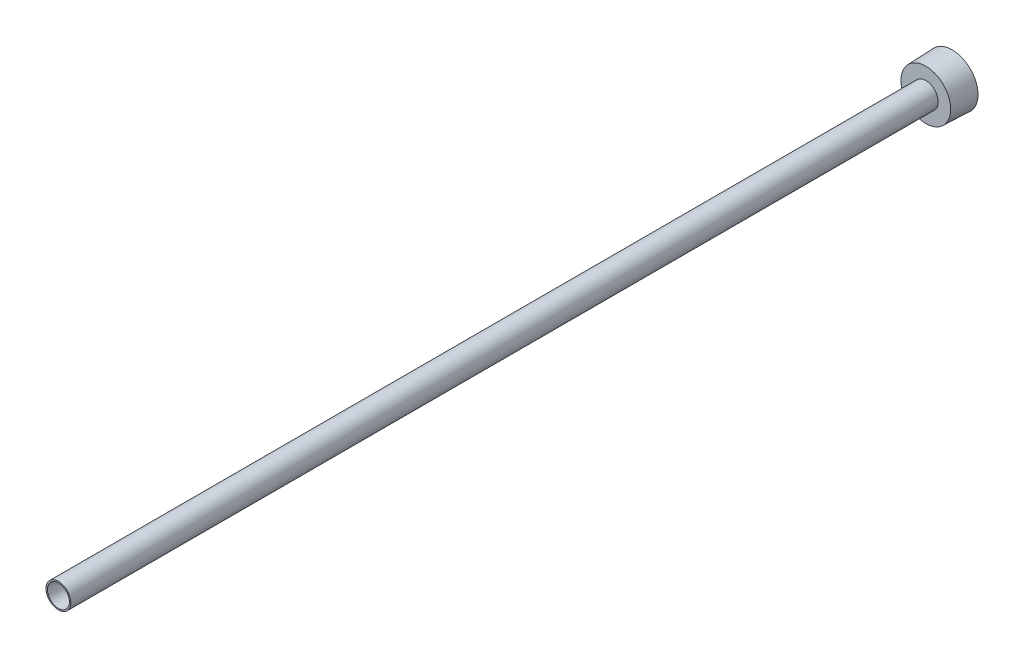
ISO-10303-21;
HEADER;
FILE_DESCRIPTION(('STEP AP214'),'2;1');
FILE_NAME('part.step','',(''),(''),'','','');
FILE_SCHEMA(('AUTOMOTIVE_DESIGN { 1 0 10303 214 1 1 1 1 }'));
ENDSEC;
DATA;
#1=APPLICATION_CONTEXT('core data for automotive mechanical design processes');
#2=APPLICATION_PROTOCOL_DEFINITION('international standard','automotive_design',2000,#1);
#3=PRODUCT_CONTEXT('',#1,'mechanical');
#4=PRODUCT('Part','Part','',(#3));
#5=PRODUCT_RELATED_PRODUCT_CATEGORY('part','',(#4));
#6=PRODUCT_DEFINITION_FORMATION('','',#4);
#7=PRODUCT_DEFINITION_CONTEXT('part definition',#1,'design');
#8=PRODUCT_DEFINITION('design','',#6,#7);
#9=PRODUCT_DEFINITION_SHAPE('','',#8);
#10=(LENGTH_UNIT() NAMED_UNIT(*) SI_UNIT(.MILLI.,.METRE.));
#11=(NAMED_UNIT(*) PLANE_ANGLE_UNIT() SI_UNIT($,.RADIAN.));
#12=(NAMED_UNIT(*) SI_UNIT($,.STERADIAN.) SOLID_ANGLE_UNIT());
#13=UNCERTAINTY_MEASURE_WITH_UNIT(LENGTH_MEASURE(1.E-05),#10,'distance_accuracy_value','');
#14=(GEOMETRIC_REPRESENTATION_CONTEXT(3) GLOBAL_UNCERTAINTY_ASSIGNED_CONTEXT((#13)) GLOBAL_UNIT_ASSIGNED_CONTEXT((#10,
#11,#12)) REPRESENTATION_CONTEXT('',''));
#15=CARTESIAN_POINT('',(0.,0.,0.));
#16=DIRECTION('',(0.,0.,1.));
#17=DIRECTION('',(1.,0.,0.));
#18=AXIS2_PLACEMENT_3D('',#15,#16,#17);
#19=CARTESIAN_POINT('',(0.,0.,0.));
#20=DIRECTION('',(0.,0.,1.));
#21=DIRECTION('',(1.,0.,0.));
#22=AXIS2_PLACEMENT_3D('',#19,#20,#21);
#23=CYLINDRICAL_SURFACE('',#22,5.6388);
#24=CARTESIAN_POINT('',(0.,0.,457.2));
#25=DIRECTION('',(0.,0.,1.));
#26=DIRECTION('',(1.,0.,0.));
#27=AXIS2_PLACEMENT_3D('',#24,#25,#26);
#28=CIRCLE('',#27,5.6388);
#29=CARTESIAN_POINT('',(5.6388,0.,457.2));
#30=VERTEX_POINT('',#29);
#31=EDGE_CURVE('E142',#30,#30,#28,.T.);
#32=ORIENTED_EDGE('',*,*,#31,.T.);
#33=EDGE_LOOP('',(#32));
#34=FACE_BOUND('',#33,.T.);
#35=CARTESIAN_POINT('',(0.,0.,9.525));
#36=DIRECTION('',(0.,0.,-1.));
#37=DIRECTION('',(-1.,0.,0.));
#38=AXIS2_PLACEMENT_3D('',#35,#36,#37);
#39=CIRCLE('',#38,5.6388);
#40=CARTESIAN_POINT('',(-5.6388,0.,9.525));
#41=VERTEX_POINT('',#40);
#42=EDGE_CURVE('E37',#41,#41,#39,.F.);
#43=ORIENTED_EDGE('',*,*,#42,.F.);
#44=EDGE_LOOP('',(#43));
#45=FACE_BOUND('',#44,.T.);
#46=ADVANCED_FACE('F33',(#34,#45),#23,.F.);
#47=CARTESIAN_POINT('',(0.,6.34999999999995,457.2));
#48=DIRECTION('',(0.,0.,-1.));
#49=DIRECTION('',(-1.,0.,0.));
#50=AXIS2_PLACEMENT_3D('',#47,#48,#49);
#51=PLANE('',#50);
#52=ORIENTED_EDGE('',*,*,#31,.F.);
#53=EDGE_LOOP('',(#52));
#54=FACE_BOUND('',#53,.T.);
#55=CARTESIAN_POINT('',(0.,0.,457.2));
#56=DIRECTION('',(0.,0.,1.));
#57=DIRECTION('',(1.,0.,0.));
#58=AXIS2_PLACEMENT_3D('',#55,#56,#57);
#59=CIRCLE('',#58,6.34999999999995);
#60=CARTESIAN_POINT('',(6.34999999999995,0.,457.2));
#61=VERTEX_POINT('',#60);
#62=EDGE_CURVE('E145',#61,#61,#59,.T.);
#63=ORIENTED_EDGE('',*,*,#62,.T.);
#64=EDGE_LOOP('',(#63));
#65=FACE_BOUND('',#64,.T.);
#66=ADVANCED_FACE('F35',(#54,#65),#51,.F.);
#67=CARTESIAN_POINT('',(0.,0.,0.));
#68=DIRECTION('',(0.,0.,1.));
#69=DIRECTION('',(1.,0.,0.));
#70=AXIS2_PLACEMENT_3D('',#67,#68,#69);
#71=PLANE('',#70);
#72=DIRECTION('',(-0.866025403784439,-0.5,0.));
#73=VECTOR('',#72,1.);
#74=CARTESIAN_POINT('',(9.525,-5.49926131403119,0.));
#75=LINE('',#74,#73);
#76=CARTESIAN_POINT('',(9.525,-5.49926131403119,0.));
#77=VERTEX_POINT('',#76);
#78=CARTESIAN_POINT('',(0.,-10.9985226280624,0.));
#79=VERTEX_POINT('',#78);
#80=EDGE_CURVE('E124',#77,#79,#75,.T.);
#81=ORIENTED_EDGE('',*,*,#80,.F.);
#82=DIRECTION('',(0.,-1.,0.));
#83=VECTOR('',#82,1.);
#84=CARTESIAN_POINT('',(9.525,5.49926131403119,0.));
#85=LINE('',#84,#83);
#86=CARTESIAN_POINT('',(9.525,5.49926131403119,0.));
#87=VERTEX_POINT('',#86);
#88=EDGE_CURVE('E49',#87,#77,#85,.T.);
#89=ORIENTED_EDGE('',*,*,#88,.F.);
#90=DIRECTION('',(0.866025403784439,-0.5,0.));
#91=VECTOR('',#90,1.);
#92=CARTESIAN_POINT('',(0.,10.9985226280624,0.));
#93=LINE('',#92,#91);
#94=CARTESIAN_POINT('',(0.,10.9985226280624,0.));
#95=VERTEX_POINT('',#94);
#96=EDGE_CURVE('E133',#95,#87,#93,.T.);
#97=ORIENTED_EDGE('',*,*,#96,.F.);
#98=DIRECTION('',(0.866025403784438,0.5,0.));
#99=VECTOR('',#98,1.);
#100=CARTESIAN_POINT('',(-9.525,5.49926131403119,0.));
#101=LINE('',#100,#99);
#102=CARTESIAN_POINT('',(-9.525,5.49926131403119,0.));
#103=VERTEX_POINT('',#102);
#104=EDGE_CURVE('E131',#103,#95,#101,.T.);
#105=ORIENTED_EDGE('',*,*,#104,.F.);
#106=DIRECTION('',(0.,1.,0.));
#107=VECTOR('',#106,1.);
#108=CARTESIAN_POINT('',(-9.525,-5.49926131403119,0.));
#109=LINE('',#108,#107);
#110=CARTESIAN_POINT('',(-9.525,-5.49926131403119,0.));
#111=VERTEX_POINT('',#110);
#112=EDGE_CURVE('E97',#111,#103,#109,.T.);
#113=ORIENTED_EDGE('',*,*,#112,.F.);
#114=DIRECTION('',(-0.866025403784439,0.5,0.));
#115=VECTOR('',#114,1.);
#116=CARTESIAN_POINT('',(0.,-10.9985226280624,0.));
#117=LINE('',#116,#115);
#118=EDGE_CURVE('E127',#79,#111,#117,.T.);
#119=ORIENTED_EDGE('',*,*,#118,.F.);
#120=EDGE_LOOP('',(#81,#89,#97,#105,#113,#119));
#121=FACE_BOUND('',#120,.T.);
#122=CARTESIAN_POINT('',(0.,0.,0.));
#123=DIRECTION('',(0.,0.,1.));
#124=DIRECTION('',(1.,0.,0.));
#125=AXIS2_PLACEMENT_3D('',#122,#123,#124);
#126=CIRCLE('',#125,13.2207);
#127=CARTESIAN_POINT('',(13.2207,0.,0.));
#128=VERTEX_POINT('',#127);
#129=EDGE_CURVE('E11',#128,#128,#126,.T.);
#130=ORIENTED_EDGE('',*,*,#129,.F.);
#131=EDGE_LOOP('',(#130));
#132=FACE_BOUND('',#131,.T.);
#133=ADVANCED_FACE('F159',(#121,#132),#71,.F.);
#134=CARTESIAN_POINT('',(0.,0.,0.));
#135=DIRECTION('',(0.,0.,-1.));
#136=DIRECTION('',(-1.,0.,0.));
#137=AXIS2_PLACEMENT_3D('',#134,#135,#136);
#138=CONICAL_SURFACE('',#137,13.2207,0.0364599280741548);
#139=CARTESIAN_POINT('',(0.,0.,13.4874));
#140=DIRECTION('',(0.,0.,1.));
#141=DIRECTION('',(1.,0.,0.));
#142=AXIS2_PLACEMENT_3D('',#139,#140,#141);
#143=CIRCLE('',#142,12.7287323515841);
#144=CARTESIAN_POINT('',(12.7287323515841,0.,13.4874));
#145=VERTEX_POINT('',#144);
#146=EDGE_CURVE('E42',#145,#145,#143,.T.);
#147=ORIENTED_EDGE('',*,*,#146,.F.);
#148=EDGE_LOOP('',(#147));
#149=FACE_BOUND('',#148,.T.);
#150=ORIENTED_EDGE('',*,*,#129,.T.);
#151=EDGE_LOOP('',(#150));
#152=FACE_BOUND('',#151,.T.);
#153=ADVANCED_FACE('F156',(#149,#152),#138,.T.);
#154=CARTESIAN_POINT('',(0.,12.7287323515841,13.4874));
#155=DIRECTION('',(0.,0.,-1.));
#156=DIRECTION('',(-1.,0.,0.));
#157=AXIS2_PLACEMENT_3D('',#154,#155,#156);
#158=PLANE('',#157);
#159=CARTESIAN_POINT('',(0.,0.,13.4874));
#160=DIRECTION('',(0.,0.,1.));
#161=DIRECTION('',(1.,0.,0.));
#162=AXIS2_PLACEMENT_3D('',#159,#160,#161);
#163=CIRCLE('',#162,6.35);
#164=CARTESIAN_POINT('',(6.35,0.,13.4874));
#165=VERTEX_POINT('',#164);
#166=EDGE_CURVE('E148',#165,#165,#163,.T.);
#167=ORIENTED_EDGE('',*,*,#166,.F.);
#168=EDGE_LOOP('',(#167));
#169=FACE_BOUND('',#168,.T.);
#170=ORIENTED_EDGE('',*,*,#146,.T.);
#171=EDGE_LOOP('',(#170));
#172=FACE_BOUND('',#171,.T.);
#173=ADVANCED_FACE('F154',(#169,#172),#158,.F.);
#174=CARTESIAN_POINT('',(0.,0.,278.00111462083));
#175=DIRECTION('',(0.,0.,1.));
#176=DIRECTION('',(1.,0.,0.));
#177=AXIS2_PLACEMENT_3D('',#174,#175,#176);
#178=CYLINDRICAL_SURFACE('',#177,6.34999999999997);
#179=ORIENTED_EDGE('',*,*,#62,.F.);
#180=EDGE_LOOP('',(#179));
#181=FACE_BOUND('',#180,.T.);
#182=ORIENTED_EDGE('',*,*,#166,.T.);
#183=EDGE_LOOP('',(#182));
#184=FACE_BOUND('',#183,.T.);
#185=ADVANCED_FACE('F180',(#181,#184),#178,.T.);
#186=CARTESIAN_POINT('',(9.525,-5.49926131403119,9.525));
#187=DIRECTION('',(0.,0.,-1.));
#188=DIRECTION('',(-1.,0.,0.));
#189=AXIS2_PLACEMENT_3D('',#186,#187,#188);
#190=PLANE('',#189);
#191=DIRECTION('',(0.,-1.,0.));
#192=VECTOR('',#191,1.);
#193=CARTESIAN_POINT('',(9.525,5.49926131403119,9.525));
#194=LINE('',#193,#192);
#195=CARTESIAN_POINT('',(9.525,5.49926131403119,9.525));
#196=VERTEX_POINT('',#195);
#197=CARTESIAN_POINT('',(9.525,-5.49926131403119,9.525));
#198=VERTEX_POINT('',#197);
#199=EDGE_CURVE('E135',#196,#198,#194,.T.);
#200=ORIENTED_EDGE('',*,*,#199,.T.);
#201=DIRECTION('',(-0.866025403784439,-0.5,0.));
#202=VECTOR('',#201,1.);
#203=CARTESIAN_POINT('',(9.525,-5.49926131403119,9.525));
#204=LINE('',#203,#202);
#205=CARTESIAN_POINT('',(0.,-10.9985226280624,9.525));
#206=VERTEX_POINT('',#205);
#207=EDGE_CURVE('E118',#198,#206,#204,.T.);
#208=ORIENTED_EDGE('',*,*,#207,.T.);
#209=DIRECTION('',(-0.866025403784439,0.5,0.));
#210=VECTOR('',#209,1.);
#211=CARTESIAN_POINT('',(0.,-10.9985226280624,9.525));
#212=LINE('',#211,#210);
#213=CARTESIAN_POINT('',(-9.525,-5.49926131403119,9.525));
#214=VERTEX_POINT('',#213);
#215=EDGE_CURVE('E116',#206,#214,#212,.T.);
#216=ORIENTED_EDGE('',*,*,#215,.T.);
#217=DIRECTION('',(0.,1.,0.));
#218=VECTOR('',#217,1.);
#219=CARTESIAN_POINT('',(-9.525,-5.49926131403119,9.525));
#220=LINE('',#219,#218);
#221=CARTESIAN_POINT('',(-9.525,5.49926131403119,9.525));
#222=VERTEX_POINT('',#221);
#223=EDGE_CURVE('E94',#214,#222,#220,.T.);
#224=ORIENTED_EDGE('',*,*,#223,.T.);
#225=DIRECTION('',(0.866025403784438,0.5,0.));
#226=VECTOR('',#225,1.);
#227=CARTESIAN_POINT('',(-9.525,5.49926131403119,9.525));
#228=LINE('',#227,#226);
#229=CARTESIAN_POINT('',(0.,10.9985226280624,9.525));
#230=VERTEX_POINT('',#229);
#231=EDGE_CURVE('E105',#222,#230,#228,.T.);
#232=ORIENTED_EDGE('',*,*,#231,.T.);
#233=DIRECTION('',(0.866025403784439,-0.5,0.));
#234=VECTOR('',#233,1.);
#235=CARTESIAN_POINT('',(0.,10.9985226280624,9.525));
#236=LINE('',#235,#234);
#237=EDGE_CURVE('E109',#230,#196,#236,.T.);
#238=ORIENTED_EDGE('',*,*,#237,.T.);
#239=EDGE_LOOP('',(#200,#208,#216,#224,#232,#238));
#240=FACE_BOUND('',#239,.T.);
#241=ORIENTED_EDGE('',*,*,#42,.T.);
#242=EDGE_LOOP('',(#241));
#243=FACE_BOUND('',#242,.T.);
#244=ADVANCED_FACE('F112',(#240,#243),#190,.T.);
#245=CARTESIAN_POINT('',(9.525,5.49926131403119,9.525));
#246=DIRECTION('',(1.,0.,0.));
#247=DIRECTION('',(0.,1.,0.));
#248=AXIS2_PLACEMENT_3D('',#245,#246,#247);
#249=PLANE('',#248);
#250=ORIENTED_EDGE('',*,*,#88,.T.);
#251=DIRECTION('',(0.,0.,-1.));
#252=VECTOR('',#251,1.);
#253=CARTESIAN_POINT('',(9.525,-5.49926131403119,9.525));
#254=LINE('',#253,#252);
#255=EDGE_CURVE('E79',#198,#77,#254,.T.);
#256=ORIENTED_EDGE('',*,*,#255,.F.);
#257=ORIENTED_EDGE('',*,*,#199,.F.);
#258=DIRECTION('',(0.,0.,-1.));
#259=VECTOR('',#258,1.);
#260=CARTESIAN_POINT('',(9.525,5.49926131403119,9.525));
#261=LINE('',#260,#259);
#262=EDGE_CURVE('E57',#196,#87,#261,.T.);
#263=ORIENTED_EDGE('',*,*,#262,.T.);
#264=EDGE_LOOP('',(#250,#256,#257,#263));
#265=FACE_BOUND('',#264,.T.);
#266=ADVANCED_FACE('F178',(#265),#249,.F.);
#267=CARTESIAN_POINT('',(0.,10.9985226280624,9.525));
#268=DIRECTION('',(0.5,0.866025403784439,0.));
#269=DIRECTION('',(-0.866025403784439,0.5,0.));
#270=AXIS2_PLACEMENT_3D('',#267,#268,#269);
#271=PLANE('',#270);
#272=ORIENTED_EDGE('',*,*,#96,.T.);
#273=ORIENTED_EDGE('',*,*,#262,.F.);
#274=ORIENTED_EDGE('',*,*,#237,.F.);
#275=DIRECTION('',(0.,0.,-1.));
#276=VECTOR('',#275,1.);
#277=CARTESIAN_POINT('',(0.,10.9985226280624,9.525));
#278=LINE('',#277,#276);
#279=EDGE_CURVE('E101',#230,#95,#278,.T.);
#280=ORIENTED_EDGE('',*,*,#279,.T.);
#281=EDGE_LOOP('',(#272,#273,#274,#280));
#282=FACE_BOUND('',#281,.T.);
#283=ADVANCED_FACE('F209',(#282),#271,.F.);
#284=CARTESIAN_POINT('',(-9.525,5.49926131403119,9.525));
#285=DIRECTION('',(-0.5,0.866025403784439,0.));
#286=DIRECTION('',(-0.866025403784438,-0.5,0.));
#287=AXIS2_PLACEMENT_3D('',#284,#285,#286);
#288=PLANE('',#287);
#289=ORIENTED_EDGE('',*,*,#104,.T.);
#290=ORIENTED_EDGE('',*,*,#279,.F.);
#291=ORIENTED_EDGE('',*,*,#231,.F.);
#292=DIRECTION('',(0.,0.,-1.));
#293=VECTOR('',#292,1.);
#294=CARTESIAN_POINT('',(-9.525,5.49926131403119,9.525));
#295=LINE('',#294,#293);
#296=EDGE_CURVE('E90',#222,#103,#295,.T.);
#297=ORIENTED_EDGE('',*,*,#296,.T.);
#298=EDGE_LOOP('',(#289,#290,#291,#297));
#299=FACE_BOUND('',#298,.T.);
#300=ADVANCED_FACE('F106',(#299),#288,.F.);
#301=CARTESIAN_POINT('',(-9.525,-5.49926131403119,9.525));
#302=DIRECTION('',(-1.,0.,0.));
#303=DIRECTION('',(0.,-1.,0.));
#304=AXIS2_PLACEMENT_3D('',#301,#302,#303);
#305=PLANE('',#304);
#306=ORIENTED_EDGE('',*,*,#112,.T.);
#307=ORIENTED_EDGE('',*,*,#296,.F.);
#308=ORIENTED_EDGE('',*,*,#223,.F.);
#309=DIRECTION('',(0.,0.,-1.));
#310=VECTOR('',#309,1.);
#311=CARTESIAN_POINT('',(-9.525,-5.49926131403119,9.525));
#312=LINE('',#311,#310);
#313=EDGE_CURVE('E102',#214,#111,#312,.T.);
#314=ORIENTED_EDGE('',*,*,#313,.T.);
#315=EDGE_LOOP('',(#306,#307,#308,#314));
#316=FACE_BOUND('',#315,.T.);
#317=ADVANCED_FACE('F92',(#316),#305,.F.);
#318=CARTESIAN_POINT('',(0.,-10.9985226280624,9.525));
#319=DIRECTION('',(-0.5,-0.866025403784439,0.));
#320=DIRECTION('',(0.866025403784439,-0.5,0.));
#321=AXIS2_PLACEMENT_3D('',#318,#319,#320);
#322=PLANE('',#321);
#323=ORIENTED_EDGE('',*,*,#118,.T.);
#324=ORIENTED_EDGE('',*,*,#313,.F.);
#325=ORIENTED_EDGE('',*,*,#215,.F.);
#326=DIRECTION('',(0.,0.,-1.));
#327=VECTOR('',#326,1.);
#328=CARTESIAN_POINT('',(0.,-10.9985226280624,9.525));
#329=LINE('',#328,#327);
#330=EDGE_CURVE('E139',#206,#79,#329,.T.);
#331=ORIENTED_EDGE('',*,*,#330,.T.);
#332=EDGE_LOOP('',(#323,#324,#325,#331));
#333=FACE_BOUND('',#332,.T.);
#334=ADVANCED_FACE('F227',(#333),#322,.F.);
#335=CARTESIAN_POINT('',(9.525,-5.49926131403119,9.525));
#336=DIRECTION('',(0.5,-0.866025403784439,0.));
#337=DIRECTION('',(0.866025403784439,0.5,0.));
#338=AXIS2_PLACEMENT_3D('',#335,#336,#337);
#339=PLANE('',#338);
#340=ORIENTED_EDGE('',*,*,#80,.T.);
#341=ORIENTED_EDGE('',*,*,#330,.F.);
#342=ORIENTED_EDGE('',*,*,#207,.F.);
#343=ORIENTED_EDGE('',*,*,#255,.T.);
#344=EDGE_LOOP('',(#340,#341,#342,#343));
#345=FACE_BOUND('',#344,.T.);
#346=ADVANCED_FACE('F234',(#345),#339,.F.);
#347=CLOSED_SHELL('',(#46,#66,#133,#153,#173,#185,#244,#266,#283,#300,#317,#334,#346));
#348=MANIFOLD_SOLID_BREP('B2',#347);
#349=ADVANCED_BREP_SHAPE_REPRESENTATION('',(#18,#348),#14);
#350=SHAPE_DEFINITION_REPRESENTATION(#9,#349);
ENDSEC;
END-ISO-10303-21;
